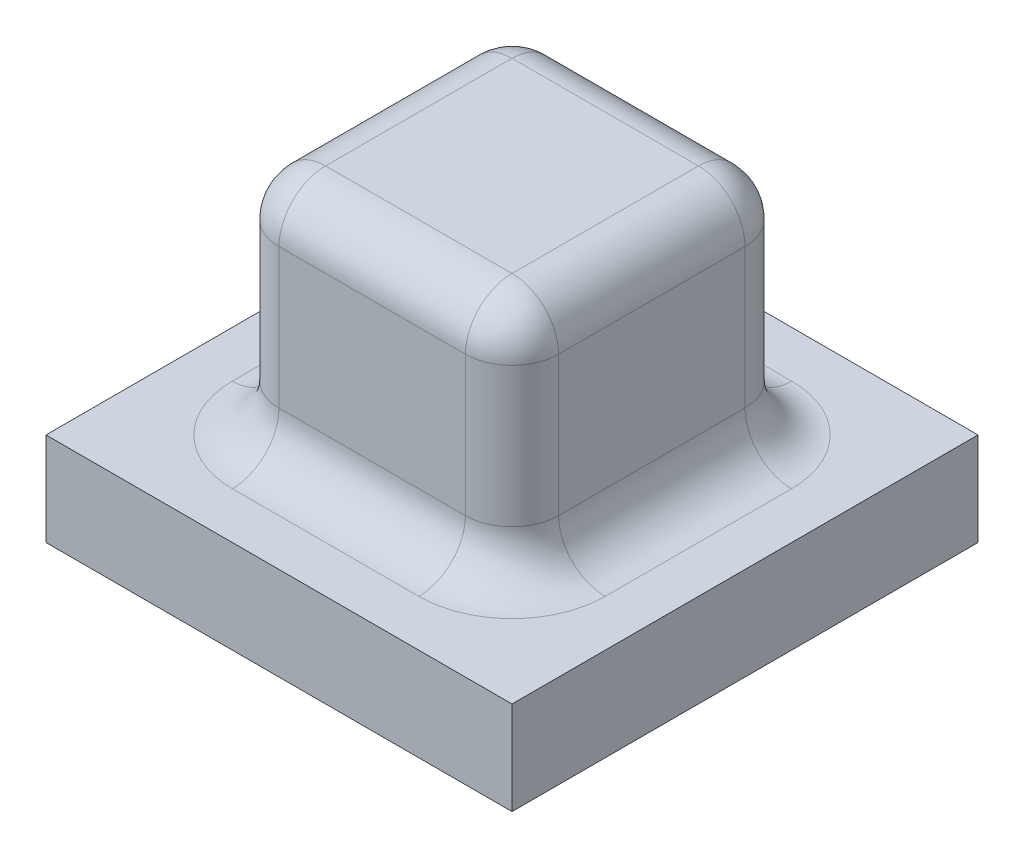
ISO-10303-21;
HEADER;
FILE_DESCRIPTION(('STEP AP214'),'2;1');
FILE_NAME('part.step','',(''),(''),'','','');
FILE_SCHEMA(('AUTOMOTIVE_DESIGN { 1 0 10303 214 1 1 1 1 }'));
ENDSEC;
DATA;
#1=APPLICATION_CONTEXT('core data for automotive mechanical design processes');
#2=APPLICATION_PROTOCOL_DEFINITION('international standard','automotive_design',2000,#1);
#3=PRODUCT_CONTEXT('',#1,'mechanical');
#4=PRODUCT('Part','Part','',(#3));
#5=PRODUCT_RELATED_PRODUCT_CATEGORY('part','',(#4));
#6=PRODUCT_DEFINITION_FORMATION('','',#4);
#7=PRODUCT_DEFINITION_CONTEXT('part definition',#1,'design');
#8=PRODUCT_DEFINITION('design','',#6,#7);
#9=PRODUCT_DEFINITION_SHAPE('','',#8);
#10=(LENGTH_UNIT() NAMED_UNIT(*) SI_UNIT(.MILLI.,.METRE.));
#11=(NAMED_UNIT(*) PLANE_ANGLE_UNIT() SI_UNIT($,.RADIAN.));
#12=(NAMED_UNIT(*) SI_UNIT($,.STERADIAN.) SOLID_ANGLE_UNIT());
#13=UNCERTAINTY_MEASURE_WITH_UNIT(LENGTH_MEASURE(1.E-05),#10,'distance_accuracy_value','');
#14=(GEOMETRIC_REPRESENTATION_CONTEXT(3) GLOBAL_UNCERTAINTY_ASSIGNED_CONTEXT((#13)) GLOBAL_UNIT_ASSIGNED_CONTEXT((#10,
#11,#12)) REPRESENTATION_CONTEXT('',''));
#15=CARTESIAN_POINT('',(0.,0.,0.));
#16=DIRECTION('',(0.,0.,1.));
#17=DIRECTION('',(1.,0.,0.));
#18=AXIS2_PLACEMENT_3D('',#15,#16,#17);
#19=CARTESIAN_POINT('',(-50.,20.,50.));
#20=DIRECTION('',(0.,-1.,0.));
#21=DIRECTION('',(1.,0.,0.));
#22=AXIS2_PLACEMENT_3D('',#19,#20,#21);
#23=PLANE('',#22);
#24=CARTESIAN_POINT('',(-20.,20.,-20.));
#25=DIRECTION('',(0.,-1.,0.));
#26=DIRECTION('',(1.,0.,0.));
#27=AXIS2_PLACEMENT_3D('',#24,#25,#26);
#28=CIRCLE('',#27,20.);
#29=CARTESIAN_POINT('',(-20.,20.,-40.));
#30=VERTEX_POINT('',#29);
#31=CARTESIAN_POINT('',(-40.,20.,-20.));
#32=VERTEX_POINT('',#31);
#33=EDGE_CURVE('E220',#30,#32,#28,.F.);
#34=ORIENTED_EDGE('',*,*,#33,.F.);
#35=DIRECTION('',(-1.,0.,0.));
#36=VECTOR('',#35,1.);
#37=CARTESIAN_POINT('',(30.,20.,-40.));
#38=LINE('',#37,#36);
#39=CARTESIAN_POINT('',(20.,20.,-40.));
#40=VERTEX_POINT('',#39);
#41=EDGE_CURVE('E226',#30,#40,#38,.F.);
#42=ORIENTED_EDGE('',*,*,#41,.T.);
#43=CARTESIAN_POINT('',(20.,20.,-20.));
#44=DIRECTION('',(0.,-1.,0.));
#45=DIRECTION('',(1.,0.,0.));
#46=AXIS2_PLACEMENT_3D('',#43,#44,#45);
#47=CIRCLE('',#46,20.);
#48=CARTESIAN_POINT('',(40.,20.,-20.));
#49=VERTEX_POINT('',#48);
#50=EDGE_CURVE('E223',#49,#40,#47,.F.);
#51=ORIENTED_EDGE('',*,*,#50,.F.);
#52=DIRECTION('',(0.,0.,-1.));
#53=VECTOR('',#52,1.);
#54=CARTESIAN_POINT('',(40.,20.,30.));
#55=LINE('',#54,#53);
#56=CARTESIAN_POINT('',(40.,20.,20.));
#57=VERTEX_POINT('',#56);
#58=EDGE_CURVE('E217',#49,#57,#55,.F.);
#59=ORIENTED_EDGE('',*,*,#58,.T.);
#60=CARTESIAN_POINT('',(20.,20.,20.));
#61=DIRECTION('',(0.,-1.,0.));
#62=DIRECTION('',(1.,0.,0.));
#63=AXIS2_PLACEMENT_3D('',#60,#61,#62);
#64=CIRCLE('',#63,20.);
#65=CARTESIAN_POINT('',(20.,20.,40.));
#66=VERTEX_POINT('',#65);
#67=EDGE_CURVE('E214',#66,#57,#64,.F.);
#68=ORIENTED_EDGE('',*,*,#67,.F.);
#69=DIRECTION('',(1.,0.,0.));
#70=VECTOR('',#69,1.);
#71=CARTESIAN_POINT('',(-30.,20.,40.));
#72=LINE('',#71,#70);
#73=CARTESIAN_POINT('',(-20.,20.,40.));
#74=VERTEX_POINT('',#73);
#75=EDGE_CURVE('E210',#66,#74,#72,.F.);
#76=ORIENTED_EDGE('',*,*,#75,.T.);
#77=CARTESIAN_POINT('',(-20.,20.,20.));
#78=DIRECTION('',(0.,-1.,0.));
#79=DIRECTION('',(1.,0.,0.));
#80=AXIS2_PLACEMENT_3D('',#77,#78,#79);
#81=CIRCLE('',#80,20.);
#82=CARTESIAN_POINT('',(-40.,20.,20.));
#83=VERTEX_POINT('',#82);
#84=EDGE_CURVE('E207',#83,#74,#81,.F.);
#85=ORIENTED_EDGE('',*,*,#84,.F.);
#86=DIRECTION('',(0.,0.,1.));
#87=VECTOR('',#86,1.);
#88=CARTESIAN_POINT('',(-40.,20.,-30.));
#89=LINE('',#88,#87);
#90=EDGE_CURVE('E212',#83,#32,#89,.F.);
#91=ORIENTED_EDGE('',*,*,#90,.T.);
#92=EDGE_LOOP('',(#34,#42,#51,#59,#68,#76,#85,#91));
#93=FACE_BOUND('',#92,.T.);
#94=DIRECTION('',(-1.,0.,0.));
#95=VECTOR('',#94,1.);
#96=CARTESIAN_POINT('',(-50.,20.,-50.));
#97=LINE('',#96,#95);
#98=CARTESIAN_POINT('',(50.,20.,-50.));
#99=VERTEX_POINT('',#98);
#100=CARTESIAN_POINT('',(-50.,20.,-50.));
#101=VERTEX_POINT('',#100);
#102=EDGE_CURVE('E185',#99,#101,#97,.T.);
#103=ORIENTED_EDGE('',*,*,#102,.T.);
#104=DIRECTION('',(0.,0.,-1.));
#105=VECTOR('',#104,1.);
#106=CARTESIAN_POINT('',(-50.,20.,50.));
#107=LINE('',#106,#105);
#108=CARTESIAN_POINT('',(-50.,20.,50.));
#109=VERTEX_POINT('',#108);
#110=EDGE_CURVE('E176',#109,#101,#107,.T.);
#111=ORIENTED_EDGE('',*,*,#110,.F.);
#112=DIRECTION('',(-1.,0.,0.));
#113=VECTOR('',#112,1.);
#114=CARTESIAN_POINT('',(-50.,20.,50.));
#115=LINE('',#114,#113);
#116=CARTESIAN_POINT('',(50.,20.,50.));
#117=VERTEX_POINT('',#116);
#118=EDGE_CURVE('E192',#117,#109,#115,.T.);
#119=ORIENTED_EDGE('',*,*,#118,.F.);
#120=DIRECTION('',(0.,0.,-1.));
#121=VECTOR('',#120,1.);
#122=CARTESIAN_POINT('',(50.,20.,50.));
#123=LINE('',#122,#121);
#124=EDGE_CURVE('E195',#117,#99,#123,.T.);
#125=ORIENTED_EDGE('',*,*,#124,.T.);
#126=EDGE_LOOP('',(#103,#111,#119,#125));
#127=FACE_BOUND('',#126,.T.);
#128=ADVANCED_FACE('F31',(#93,#127),#23,.F.);
#129=CARTESIAN_POINT('',(-50.,20.,50.));
#130=DIRECTION('',(1.,0.,0.));
#131=DIRECTION('',(0.,1.,0.));
#132=AXIS2_PLACEMENT_3D('',#129,#130,#131);
#133=PLANE('',#132);
#134=DIRECTION('',(0.,-1.,0.));
#135=VECTOR('',#134,1.);
#136=CARTESIAN_POINT('',(-50.,20.,-50.));
#137=LINE('',#136,#135);
#138=CARTESIAN_POINT('',(-50.,0.,-50.));
#139=VERTEX_POINT('',#138);
#140=EDGE_CURVE('E158',#101,#139,#137,.T.);
#141=ORIENTED_EDGE('',*,*,#140,.T.);
#142=DIRECTION('',(0.,0.,-1.));
#143=VECTOR('',#142,1.);
#144=CARTESIAN_POINT('',(-50.,0.,50.));
#145=LINE('',#144,#143);
#146=CARTESIAN_POINT('',(-50.,0.,50.));
#147=VERTEX_POINT('',#146);
#148=EDGE_CURVE('E165',#147,#139,#145,.T.);
#149=ORIENTED_EDGE('',*,*,#148,.F.);
#150=DIRECTION('',(0.,-1.,0.));
#151=VECTOR('',#150,1.);
#152=CARTESIAN_POINT('',(-50.,20.,50.));
#153=LINE('',#152,#151);
#154=EDGE_CURVE('E187',#109,#147,#153,.T.);
#155=ORIENTED_EDGE('',*,*,#154,.F.);
#156=ORIENTED_EDGE('',*,*,#110,.T.);
#157=EDGE_LOOP('',(#141,#149,#155,#156));
#158=FACE_BOUND('',#157,.T.);
#159=ADVANCED_FACE('F33',(#158),#133,.F.);
#160=CARTESIAN_POINT('',(-50.,0.,50.));
#161=DIRECTION('',(0.,1.,0.));
#162=DIRECTION('',(0.,0.,1.));
#163=AXIS2_PLACEMENT_3D('',#160,#161,#162);
#164=PLANE('',#163);
#165=DIRECTION('',(1.,0.,0.));
#166=VECTOR('',#165,1.);
#167=CARTESIAN_POINT('',(-50.,0.,-50.));
#168=LINE('',#167,#166);
#169=CARTESIAN_POINT('',(50.,0.,-50.));
#170=VERTEX_POINT('',#169);
#171=EDGE_CURVE('E153',#139,#170,#168,.T.);
#172=ORIENTED_EDGE('',*,*,#171,.T.);
#173=DIRECTION('',(0.,0.,-1.));
#174=VECTOR('',#173,1.);
#175=CARTESIAN_POINT('',(50.,0.,50.));
#176=LINE('',#175,#174);
#177=CARTESIAN_POINT('',(50.,0.,50.));
#178=VERTEX_POINT('',#177);
#179=EDGE_CURVE('E172',#178,#170,#176,.T.);
#180=ORIENTED_EDGE('',*,*,#179,.F.);
#181=DIRECTION('',(1.,0.,0.));
#182=VECTOR('',#181,1.);
#183=CARTESIAN_POINT('',(-50.,0.,50.));
#184=LINE('',#183,#182);
#185=EDGE_CURVE('E167',#147,#178,#184,.T.);
#186=ORIENTED_EDGE('',*,*,#185,.F.);
#187=ORIENTED_EDGE('',*,*,#148,.T.);
#188=EDGE_LOOP('',(#172,#180,#186,#187));
#189=FACE_BOUND('',#188,.T.);
#190=ADVANCED_FACE('F166',(#189),#164,.F.);
#191=CARTESIAN_POINT('',(50.,20.,50.));
#192=DIRECTION('',(-1.,0.,0.));
#193=DIRECTION('',(0.,0.,1.));
#194=AXIS2_PLACEMENT_3D('',#191,#192,#193);
#195=PLANE('',#194);
#196=DIRECTION('',(0.,1.,0.));
#197=VECTOR('',#196,1.);
#198=CARTESIAN_POINT('',(50.,20.,-50.));
#199=LINE('',#198,#197);
#200=EDGE_CURVE('E159',#170,#99,#199,.T.);
#201=ORIENTED_EDGE('',*,*,#200,.T.);
#202=ORIENTED_EDGE('',*,*,#124,.F.);
#203=DIRECTION('',(0.,1.,0.));
#204=VECTOR('',#203,1.);
#205=CARTESIAN_POINT('',(50.,20.,50.));
#206=LINE('',#205,#204);
#207=EDGE_CURVE('E190',#178,#117,#206,.T.);
#208=ORIENTED_EDGE('',*,*,#207,.F.);
#209=ORIENTED_EDGE('',*,*,#179,.T.);
#210=EDGE_LOOP('',(#201,#202,#208,#209));
#211=FACE_BOUND('',#210,.T.);
#212=ADVANCED_FACE('F427',(#211),#195,.F.);
#213=CARTESIAN_POINT('',(-50.,20.,50.));
#214=DIRECTION('',(0.,0.,1.));
#215=DIRECTION('',(1.,0.,0.));
#216=AXIS2_PLACEMENT_3D('',#213,#214,#215);
#217=PLANE('',#216);
#218=ORIENTED_EDGE('',*,*,#154,.T.);
#219=ORIENTED_EDGE('',*,*,#185,.T.);
#220=ORIENTED_EDGE('',*,*,#207,.T.);
#221=ORIENTED_EDGE('',*,*,#118,.T.);
#222=EDGE_LOOP('',(#218,#219,#220,#221));
#223=FACE_BOUND('',#222,.T.);
#224=ADVANCED_FACE('F418',(#223),#217,.T.);
#225=CARTESIAN_POINT('',(-50.,20.,-50.));
#226=DIRECTION('',(0.,0.,1.));
#227=DIRECTION('',(1.,0.,0.));
#228=AXIS2_PLACEMENT_3D('',#225,#226,#227);
#229=PLANE('',#228);
#230=ORIENTED_EDGE('',*,*,#140,.F.);
#231=ORIENTED_EDGE('',*,*,#102,.F.);
#232=ORIENTED_EDGE('',*,*,#200,.F.);
#233=ORIENTED_EDGE('',*,*,#171,.F.);
#234=EDGE_LOOP('',(#230,#231,#232,#233));
#235=FACE_BOUND('',#234,.T.);
#236=ADVANCED_FACE('F155',(#235),#229,.F.);
#237=CARTESIAN_POINT('',(30.,70.,30.));
#238=DIRECTION('',(-1.,0.,0.));
#239=DIRECTION('',(0.,-1.,0.));
#240=AXIS2_PLACEMENT_3D('',#237,#238,#239);
#241=PLANE('',#240);
#242=DIRECTION('',(0.,-1.,0.));
#243=VECTOR('',#242,1.);
#244=CARTESIAN_POINT('',(30.,70.,20.));
#245=LINE('',#244,#243);
#246=CARTESIAN_POINT('',(30.,60.,20.));
#247=VERTEX_POINT('',#246);
#248=CARTESIAN_POINT('',(30.,30.,20.));
#249=VERTEX_POINT('',#248);
#250=EDGE_CURVE('E200',#247,#249,#245,.T.);
#251=ORIENTED_EDGE('',*,*,#250,.T.);
#252=DIRECTION('',(0.,0.,-1.));
#253=VECTOR('',#252,1.);
#254=CARTESIAN_POINT('',(30.,30.,-30.));
#255=LINE('',#254,#253);
#256=CARTESIAN_POINT('',(30.,30.,-20.));
#257=VERTEX_POINT('',#256);
#258=EDGE_CURVE('E204',#249,#257,#255,.T.);
#259=ORIENTED_EDGE('',*,*,#258,.T.);
#260=DIRECTION('',(0.,-1.,0.));
#261=VECTOR('',#260,1.);
#262=CARTESIAN_POINT('',(30.,70.,-20.));
#263=LINE('',#262,#261);
#264=CARTESIAN_POINT('',(30.,60.,-20.));
#265=VERTEX_POINT('',#264);
#266=EDGE_CURVE('E202',#257,#265,#263,.F.);
#267=ORIENTED_EDGE('',*,*,#266,.T.);
#268=DIRECTION('',(0.,0.,-1.));
#269=VECTOR('',#268,1.);
#270=CARTESIAN_POINT('',(30.,60.,30.));
#271=LINE('',#270,#269);
#272=EDGE_CURVE('E171',#265,#247,#271,.F.);
#273=ORIENTED_EDGE('',*,*,#272,.T.);
#274=EDGE_LOOP('',(#251,#259,#267,#273));
#275=FACE_BOUND('',#274,.T.);
#276=ADVANCED_FACE('F408',(#275),#241,.F.);
#277=CARTESIAN_POINT('',(30.,70.,-30.));
#278=DIRECTION('',(0.,0.,1.));
#279=DIRECTION('',(1.,0.,0.));
#280=AXIS2_PLACEMENT_3D('',#277,#278,#279);
#281=PLANE('',#280);
#282=DIRECTION('',(-1.,0.,0.));
#283=VECTOR('',#282,1.);
#284=CARTESIAN_POINT('',(30.,60.,-30.));
#285=LINE('',#284,#283);
#286=CARTESIAN_POINT('',(-20.,60.,-30.));
#287=VERTEX_POINT('',#286);
#288=CARTESIAN_POINT('',(20.,60.,-30.));
#289=VERTEX_POINT('',#288);
#290=EDGE_CURVE('E228',#287,#289,#285,.F.);
#291=ORIENTED_EDGE('',*,*,#290,.T.);
#292=DIRECTION('',(0.,-1.,0.));
#293=VECTOR('',#292,1.);
#294=CARTESIAN_POINT('',(20.,70.,-30.));
#295=LINE('',#294,#293);
#296=CARTESIAN_POINT('',(20.,30.,-30.));
#297=VERTEX_POINT('',#296);
#298=EDGE_CURVE('E234',#289,#297,#295,.T.);
#299=ORIENTED_EDGE('',*,*,#298,.T.);
#300=DIRECTION('',(-1.,0.,0.));
#301=VECTOR('',#300,1.);
#302=CARTESIAN_POINT('',(-30.,30.,-30.));
#303=LINE('',#302,#301);
#304=CARTESIAN_POINT('',(-20.,30.,-30.));
#305=VERTEX_POINT('',#304);
#306=EDGE_CURVE('E232',#297,#305,#303,.T.);
#307=ORIENTED_EDGE('',*,*,#306,.T.);
#308=DIRECTION('',(0.,-1.,0.));
#309=VECTOR('',#308,1.);
#310=CARTESIAN_POINT('',(-20.,70.,-30.));
#311=LINE('',#310,#309);
#312=EDGE_CURVE('E230',#305,#287,#311,.F.);
#313=ORIENTED_EDGE('',*,*,#312,.T.);
#314=EDGE_LOOP('',(#291,#299,#307,#313));
#315=FACE_BOUND('',#314,.T.);
#316=ADVANCED_FACE('F410',(#315),#281,.F.);
#317=CARTESIAN_POINT('',(-30.,70.,30.));
#318=DIRECTION('',(1.,0.,0.));
#319=DIRECTION('',(0.,1.,0.));
#320=AXIS2_PLACEMENT_3D('',#317,#318,#319);
#321=PLANE('',#320);
#322=DIRECTION('',(0.,0.,1.));
#323=VECTOR('',#322,1.);
#324=CARTESIAN_POINT('',(-30.,60.,-30.));
#325=LINE('',#324,#323);
#326=CARTESIAN_POINT('',(-30.,60.,20.));
#327=VERTEX_POINT('',#326);
#328=CARTESIAN_POINT('',(-30.,60.,-20.));
#329=VERTEX_POINT('',#328);
#330=EDGE_CURVE('E237',#327,#329,#325,.F.);
#331=ORIENTED_EDGE('',*,*,#330,.T.);
#332=DIRECTION('',(0.,-1.,0.));
#333=VECTOR('',#332,1.);
#334=CARTESIAN_POINT('',(-30.,70.,-20.));
#335=LINE('',#334,#333);
#336=CARTESIAN_POINT('',(-30.,30.,-20.));
#337=VERTEX_POINT('',#336);
#338=EDGE_CURVE('E243',#329,#337,#335,.T.);
#339=ORIENTED_EDGE('',*,*,#338,.T.);
#340=DIRECTION('',(0.,0.,1.));
#341=VECTOR('',#340,1.);
#342=CARTESIAN_POINT('',(-30.,30.,30.));
#343=LINE('',#342,#341);
#344=CARTESIAN_POINT('',(-30.,30.,20.));
#345=VERTEX_POINT('',#344);
#346=EDGE_CURVE('E241',#337,#345,#343,.T.);
#347=ORIENTED_EDGE('',*,*,#346,.T.);
#348=DIRECTION('',(0.,-1.,0.));
#349=VECTOR('',#348,1.);
#350=CARTESIAN_POINT('',(-30.,70.,20.));
#351=LINE('',#350,#349);
#352=EDGE_CURVE('E239',#345,#327,#351,.F.);
#353=ORIENTED_EDGE('',*,*,#352,.T.);
#354=EDGE_LOOP('',(#331,#339,#347,#353));
#355=FACE_BOUND('',#354,.T.);
#356=ADVANCED_FACE('F362',(#355),#321,.F.);
#357=CARTESIAN_POINT('',(30.,70.,30.));
#358=DIRECTION('',(0.,0.,-1.));
#359=DIRECTION('',(-1.,0.,0.));
#360=AXIS2_PLACEMENT_3D('',#357,#358,#359);
#361=PLANE('',#360);
#362=DIRECTION('',(0.,-1.,0.));
#363=VECTOR('',#362,1.);
#364=CARTESIAN_POINT('',(-20.,70.,30.));
#365=LINE('',#364,#363);
#366=CARTESIAN_POINT('',(-20.,60.,30.));
#367=VERTEX_POINT('',#366);
#368=CARTESIAN_POINT('',(-20.,30.,30.));
#369=VERTEX_POINT('',#368);
#370=EDGE_CURVE('E250',#367,#369,#365,.T.);
#371=ORIENTED_EDGE('',*,*,#370,.T.);
#372=DIRECTION('',(1.,0.,0.));
#373=VECTOR('',#372,1.);
#374=CARTESIAN_POINT('',(30.,30.,30.));
#375=LINE('',#374,#373);
#376=CARTESIAN_POINT('',(20.,30.,30.));
#377=VERTEX_POINT('',#376);
#378=EDGE_CURVE('E253',#369,#377,#375,.T.);
#379=ORIENTED_EDGE('',*,*,#378,.T.);
#380=DIRECTION('',(0.,-1.,0.));
#381=VECTOR('',#380,1.);
#382=CARTESIAN_POINT('',(20.,70.,30.));
#383=LINE('',#382,#381);
#384=CARTESIAN_POINT('',(20.,60.,30.));
#385=VERTEX_POINT('',#384);
#386=EDGE_CURVE('E248',#377,#385,#383,.F.);
#387=ORIENTED_EDGE('',*,*,#386,.T.);
#388=DIRECTION('',(1.,0.,0.));
#389=VECTOR('',#388,1.);
#390=CARTESIAN_POINT('',(-30.,60.,30.));
#391=LINE('',#390,#389);
#392=EDGE_CURVE('E246',#385,#367,#391,.F.);
#393=ORIENTED_EDGE('',*,*,#392,.T.);
#394=EDGE_LOOP('',(#371,#379,#387,#393));
#395=FACE_BOUND('',#394,.T.);
#396=ADVANCED_FACE('F367',(#395),#361,.F.);
#397=CARTESIAN_POINT('',(30.,70.,-30.));
#398=DIRECTION('',(0.,1.,0.));
#399=DIRECTION('',(-1.,0.,0.));
#400=AXIS2_PLACEMENT_3D('',#397,#398,#399);
#401=PLANE('',#400);
#402=DIRECTION('',(0.,0.,1.));
#403=VECTOR('',#402,1.);
#404=CARTESIAN_POINT('',(-20.,70.,30.));
#405=LINE('',#404,#403);
#406=CARTESIAN_POINT('',(-20.,70.,-20.));
#407=VERTEX_POINT('',#406);
#408=CARTESIAN_POINT('',(-20.,70.,20.));
#409=VERTEX_POINT('',#408);
#410=EDGE_CURVE('E39',#407,#409,#405,.T.);
#411=ORIENTED_EDGE('',*,*,#410,.T.);
#412=DIRECTION('',(1.,0.,0.));
#413=VECTOR('',#412,1.);
#414=CARTESIAN_POINT('',(30.,70.,20.));
#415=LINE('',#414,#413);
#416=CARTESIAN_POINT('',(20.,70.,20.));
#417=VERTEX_POINT('',#416);
#418=EDGE_CURVE('E11',#409,#417,#415,.T.);
#419=ORIENTED_EDGE('',*,*,#418,.T.);
#420=DIRECTION('',(0.,0.,-1.));
#421=VECTOR('',#420,1.);
#422=CARTESIAN_POINT('',(20.,70.,-30.));
#423=LINE('',#422,#421);
#424=CARTESIAN_POINT('',(20.,70.,-20.));
#425=VERTEX_POINT('',#424);
#426=EDGE_CURVE('E255',#417,#425,#423,.T.);
#427=ORIENTED_EDGE('',*,*,#426,.T.);
#428=DIRECTION('',(-1.,0.,0.));
#429=VECTOR('',#428,1.);
#430=CARTESIAN_POINT('',(-30.,70.,-20.));
#431=LINE('',#430,#429);
#432=EDGE_CURVE('E49',#425,#407,#431,.T.);
#433=ORIENTED_EDGE('',*,*,#432,.T.);
#434=EDGE_LOOP('',(#411,#419,#427,#433));
#435=FACE_BOUND('',#434,.T.);
#436=ADVANCED_FACE('F258',(#435),#401,.T.);
#437=CARTESIAN_POINT('',(-20.,60.,-30.));
#438=DIRECTION('',(0.,0.,-1.));
#439=DIRECTION('',(-1.,0.,0.));
#440=AXIS2_PLACEMENT_3D('',#437,#438,#439);
#441=CYLINDRICAL_SURFACE('',#440,10.);
#442=CARTESIAN_POINT('',(-20.,60.,20.));
#443=DIRECTION('',(0.,0.,1.));
#444=DIRECTION('',(1.,0.,0.));
#445=AXIS2_PLACEMENT_3D('',#442,#443,#444);
#446=CIRCLE('',#445,10.);
#447=EDGE_CURVE('E177',#409,#327,#446,.T.);
#448=ORIENTED_EDGE('',*,*,#447,.F.);
#449=ORIENTED_EDGE('',*,*,#410,.F.);
#450=CARTESIAN_POINT('',(-20.,60.,-20.));
#451=DIRECTION('',(0.,0.,-1.));
#452=DIRECTION('',(0.,1.,0.));
#453=AXIS2_PLACEMENT_3D('',#450,#451,#452);
#454=CIRCLE('',#453,10.);
#455=EDGE_CURVE('E180',#329,#407,#454,.T.);
#456=ORIENTED_EDGE('',*,*,#455,.F.);
#457=ORIENTED_EDGE('',*,*,#330,.F.);
#458=EDGE_LOOP('',(#448,#449,#456,#457));
#459=FACE_BOUND('',#458,.T.);
#460=ADVANCED_FACE('F318',(#459),#441,.T.);
#461=CARTESIAN_POINT('',(-20.,60.,20.));
#462=DIRECTION('',(0.,0.,1.));
#463=DIRECTION('',(1.,0.,0.));
#464=AXIS2_PLACEMENT_3D('',#461,#462,#463);
#465=SPHERICAL_SURFACE('',#464,10.);
#466=CARTESIAN_POINT('',(-20.,60.,20.));
#467=DIRECTION('',(-1.,0.,0.));
#468=DIRECTION('',(0.,-1.,0.));
#469=AXIS2_PLACEMENT_3D('',#466,#467,#468);
#470=CIRCLE('',#469,10.);
#471=EDGE_CURVE('E305',#409,#367,#470,.F.);
#472=ORIENTED_EDGE('',*,*,#471,.F.);
#473=ORIENTED_EDGE('',*,*,#447,.T.);
#474=CARTESIAN_POINT('',(-20.,60.,20.));
#475=DIRECTION('',(0.,1.,0.));
#476=DIRECTION('',(0.,0.,1.));
#477=AXIS2_PLACEMENT_3D('',#474,#475,#476);
#478=CIRCLE('',#477,10.);
#479=EDGE_CURVE('E308',#367,#327,#478,.F.);
#480=ORIENTED_EDGE('',*,*,#479,.F.);
#481=EDGE_LOOP('',(#472,#473,#480));
#482=FACE_BOUND('',#481,.T.);
#483=ADVANCED_FACE('F322',(#482),#465,.T.);
#484=CARTESIAN_POINT('',(-20.,60.,-20.));
#485=DIRECTION('',(0.,0.,1.));
#486=DIRECTION('',(1.,0.,0.));
#487=AXIS2_PLACEMENT_3D('',#484,#485,#486);
#488=SPHERICAL_SURFACE('',#487,10.);
#489=CARTESIAN_POINT('',(-20.,60.,-20.));
#490=DIRECTION('',(0.,1.,0.));
#491=DIRECTION('',(0.,0.,1.));
#492=AXIS2_PLACEMENT_3D('',#489,#490,#491);
#493=CIRCLE('',#492,10.);
#494=EDGE_CURVE('E301',#329,#287,#493,.F.);
#495=ORIENTED_EDGE('',*,*,#494,.F.);
#496=ORIENTED_EDGE('',*,*,#455,.T.);
#497=CARTESIAN_POINT('',(-20.,60.,-20.));
#498=DIRECTION('',(-1.,0.,0.));
#499=DIRECTION('',(0.,0.,1.));
#500=AXIS2_PLACEMENT_3D('',#497,#498,#499);
#501=CIRCLE('',#500,10.);
#502=EDGE_CURVE('E272',#287,#407,#501,.F.);
#503=ORIENTED_EDGE('',*,*,#502,.F.);
#504=EDGE_LOOP('',(#495,#496,#503));
#505=FACE_BOUND('',#504,.T.);
#506=ADVANCED_FACE('F314',(#505),#488,.T.);
#507=CARTESIAN_POINT('',(-20.,70.,20.));
#508=DIRECTION('',(0.,-1.,0.));
#509=DIRECTION('',(1.,0.,0.));
#510=AXIS2_PLACEMENT_3D('',#507,#508,#509);
#511=CYLINDRICAL_SURFACE('',#510,10.);
#512=ORIENTED_EDGE('',*,*,#479,.T.);
#513=ORIENTED_EDGE('',*,*,#352,.F.);
#514=CARTESIAN_POINT('',(-20.,30.,20.));
#515=DIRECTION('',(0.,-1.,0.));
#516=DIRECTION('',(1.,0.,0.));
#517=AXIS2_PLACEMENT_3D('',#514,#515,#516);
#518=CIRCLE('',#517,10.);
#519=EDGE_CURVE('E295',#369,#345,#518,.T.);
#520=ORIENTED_EDGE('',*,*,#519,.F.);
#521=ORIENTED_EDGE('',*,*,#370,.F.);
#522=EDGE_LOOP('',(#512,#513,#520,#521));
#523=FACE_BOUND('',#522,.T.);
#524=ADVANCED_FACE('F365',(#523),#511,.T.);
#525=CARTESIAN_POINT('',(30.,60.,20.));
#526=DIRECTION('',(-1.,0.,0.));
#527=DIRECTION('',(0.,-1.,0.));
#528=AXIS2_PLACEMENT_3D('',#525,#526,#527);
#529=CYLINDRICAL_SURFACE('',#528,10.);
#530=ORIENTED_EDGE('',*,*,#471,.T.);
#531=ORIENTED_EDGE('',*,*,#392,.F.);
#532=CARTESIAN_POINT('',(20.,60.,20.));
#533=DIRECTION('',(1.,0.,0.));
#534=DIRECTION('',(0.,0.,-1.));
#535=AXIS2_PLACEMENT_3D('',#532,#533,#534);
#536=CIRCLE('',#535,10.);
#537=EDGE_CURVE('E292',#417,#385,#536,.T.);
#538=ORIENTED_EDGE('',*,*,#537,.F.);
#539=ORIENTED_EDGE('',*,*,#418,.F.);
#540=EDGE_LOOP('',(#530,#531,#538,#539));
#541=FACE_BOUND('',#540,.T.);
#542=ADVANCED_FACE('F327',(#541),#529,.T.);
#543=CARTESIAN_POINT('',(20.,60.,-30.));
#544=DIRECTION('',(0.,0.,1.));
#545=DIRECTION('',(1.,0.,0.));
#546=AXIS2_PLACEMENT_3D('',#543,#544,#545);
#547=CYLINDRICAL_SURFACE('',#546,10.);
#548=CARTESIAN_POINT('',(20.,60.,-20.));
#549=DIRECTION('',(0.,0.,-1.));
#550=DIRECTION('',(-1.,0.,0.));
#551=AXIS2_PLACEMENT_3D('',#548,#549,#550);
#552=CIRCLE('',#551,10.);
#553=EDGE_CURVE('E275',#425,#265,#552,.T.);
#554=ORIENTED_EDGE('',*,*,#553,.F.);
#555=ORIENTED_EDGE('',*,*,#426,.F.);
#556=CARTESIAN_POINT('',(20.,60.,20.));
#557=DIRECTION('',(0.,0.,1.));
#558=DIRECTION('',(0.,-1.,0.));
#559=AXIS2_PLACEMENT_3D('',#556,#557,#558);
#560=CIRCLE('',#559,10.);
#561=EDGE_CURVE('E279',#247,#417,#560,.T.);
#562=ORIENTED_EDGE('',*,*,#561,.F.);
#563=ORIENTED_EDGE('',*,*,#272,.F.);
#564=EDGE_LOOP('',(#554,#555,#562,#563));
#565=FACE_BOUND('',#564,.T.);
#566=ADVANCED_FACE('F276',(#565),#547,.T.);
#567=CARTESIAN_POINT('',(30.,60.,-20.));
#568=DIRECTION('',(1.,0.,0.));
#569=DIRECTION('',(0.,1.,0.));
#570=AXIS2_PLACEMENT_3D('',#567,#568,#569);
#571=CYLINDRICAL_SURFACE('',#570,10.);
#572=ORIENTED_EDGE('',*,*,#502,.T.);
#573=ORIENTED_EDGE('',*,*,#432,.F.);
#574=CARTESIAN_POINT('',(20.,60.,-20.));
#575=DIRECTION('',(1.,0.,0.));
#576=DIRECTION('',(0.,1.,0.));
#577=AXIS2_PLACEMENT_3D('',#574,#575,#576);
#578=CIRCLE('',#577,10.);
#579=EDGE_CURVE('E269',#289,#425,#578,.T.);
#580=ORIENTED_EDGE('',*,*,#579,.F.);
#581=ORIENTED_EDGE('',*,*,#290,.F.);
#582=EDGE_LOOP('',(#572,#573,#580,#581));
#583=FACE_BOUND('',#582,.T.);
#584=ADVANCED_FACE('F266',(#583),#571,.T.);
#585=CARTESIAN_POINT('',(-20.,70.,-20.));
#586=DIRECTION('',(0.,-1.,0.));
#587=DIRECTION('',(1.,0.,0.));
#588=AXIS2_PLACEMENT_3D('',#585,#586,#587);
#589=CYLINDRICAL_SURFACE('',#588,10.);
#590=ORIENTED_EDGE('',*,*,#494,.T.);
#591=ORIENTED_EDGE('',*,*,#312,.F.);
#592=CARTESIAN_POINT('',(-20.,30.,-20.));
#593=DIRECTION('',(0.,-1.,0.));
#594=DIRECTION('',(1.,0.,0.));
#595=AXIS2_PLACEMENT_3D('',#592,#593,#594);
#596=CIRCLE('',#595,10.);
#597=EDGE_CURVE('E284',#337,#305,#596,.T.);
#598=ORIENTED_EDGE('',*,*,#597,.F.);
#599=ORIENTED_EDGE('',*,*,#338,.F.);
#600=EDGE_LOOP('',(#590,#591,#598,#599));
#601=FACE_BOUND('',#600,.T.);
#602=ADVANCED_FACE('F357',(#601),#589,.T.);
#603=CARTESIAN_POINT('',(-40.,30.,30.));
#604=DIRECTION('',(0.,0.,-1.));
#605=DIRECTION('',(-1.,0.,0.));
#606=AXIS2_PLACEMENT_3D('',#603,#604,#605);
#607=CYLINDRICAL_SURFACE('',#606,10.);
#608=CARTESIAN_POINT('',(-40.,30.,-20.));
#609=DIRECTION('',(0.,0.,1.));
#610=DIRECTION('',(1.,0.,0.));
#611=AXIS2_PLACEMENT_3D('',#608,#609,#610);
#612=CIRCLE('',#611,10.);
#613=EDGE_CURVE('E287',#32,#337,#612,.T.);
#614=ORIENTED_EDGE('',*,*,#613,.F.);
#615=ORIENTED_EDGE('',*,*,#90,.F.);
#616=CARTESIAN_POINT('',(-40.,30.,20.));
#617=DIRECTION('',(0.,0.,-1.));
#618=DIRECTION('',(-1.,0.,0.));
#619=AXIS2_PLACEMENT_3D('',#616,#617,#618);
#620=CIRCLE('',#619,10.);
#621=EDGE_CURVE('E298',#345,#83,#620,.T.);
#622=ORIENTED_EDGE('',*,*,#621,.F.);
#623=ORIENTED_EDGE('',*,*,#346,.F.);
#624=EDGE_LOOP('',(#614,#615,#622,#623));
#625=FACE_BOUND('',#624,.T.);
#626=ADVANCED_FACE('F359',(#625),#607,.F.);
#627=CARTESIAN_POINT('',(-20.,30.,20.));
#628=DIRECTION('',(0.,-1.,0.));
#629=DIRECTION('',(1.,0.,0.));
#630=AXIS2_PLACEMENT_3D('',#627,#628,#629);
#631=TOROIDAL_SURFACE('',#630,20.,10.);
#632=ORIENTED_EDGE('',*,*,#621,.T.);
#633=ORIENTED_EDGE('',*,*,#84,.T.);
#634=CARTESIAN_POINT('',(-20.,30.,40.));
#635=DIRECTION('',(1.,0.,0.));
#636=DIRECTION('',(0.,1.,0.));
#637=AXIS2_PLACEMENT_3D('',#634,#635,#636);
#638=CIRCLE('',#637,10.);
#639=EDGE_CURVE('E339',#369,#74,#638,.F.);
#640=ORIENTED_EDGE('',*,*,#639,.F.);
#641=ORIENTED_EDGE('',*,*,#519,.T.);
#642=EDGE_LOOP('',(#632,#633,#640,#641));
#643=FACE_BOUND('',#642,.T.);
#644=ADVANCED_FACE('F376',(#643),#631,.F.);
#645=CARTESIAN_POINT('',(20.,60.,20.));
#646=DIRECTION('',(0.,0.,1.));
#647=DIRECTION('',(1.,0.,0.));
#648=AXIS2_PLACEMENT_3D('',#645,#646,#647);
#649=SPHERICAL_SURFACE('',#648,10.);
#650=ORIENTED_EDGE('',*,*,#561,.T.);
#651=ORIENTED_EDGE('',*,*,#537,.T.);
#652=CARTESIAN_POINT('',(20.,60.,20.));
#653=DIRECTION('',(0.,1.,0.));
#654=DIRECTION('',(0.,0.,1.));
#655=AXIS2_PLACEMENT_3D('',#652,#653,#654);
#656=CIRCLE('',#655,10.);
#657=EDGE_CURVE('E332',#247,#385,#656,.F.);
#658=ORIENTED_EDGE('',*,*,#657,.F.);
#659=EDGE_LOOP('',(#650,#651,#658));
#660=FACE_BOUND('',#659,.T.);
#661=ADVANCED_FACE('F331',(#660),#649,.T.);
#662=CARTESIAN_POINT('',(20.,60.,-20.));
#663=DIRECTION('',(0.,0.,1.));
#664=DIRECTION('',(1.,0.,0.));
#665=AXIS2_PLACEMENT_3D('',#662,#663,#664);
#666=SPHERICAL_SURFACE('',#665,10.);
#667=ORIENTED_EDGE('',*,*,#579,.T.);
#668=ORIENTED_EDGE('',*,*,#553,.T.);
#669=CARTESIAN_POINT('',(20.,60.,-20.));
#670=DIRECTION('',(0.,1.,0.));
#671=DIRECTION('',(0.,0.,1.));
#672=AXIS2_PLACEMENT_3D('',#669,#670,#671);
#673=CIRCLE('',#672,10.);
#674=EDGE_CURVE('E282',#289,#265,#673,.F.);
#675=ORIENTED_EDGE('',*,*,#674,.F.);
#676=EDGE_LOOP('',(#667,#668,#675));
#677=FACE_BOUND('',#676,.T.);
#678=ADVANCED_FACE('F281',(#677),#666,.T.);
#679=CARTESIAN_POINT('',(-20.,30.,-20.));
#680=DIRECTION('',(0.,-1.,0.));
#681=DIRECTION('',(1.,0.,0.));
#682=AXIS2_PLACEMENT_3D('',#679,#680,#681);
#683=TOROIDAL_SURFACE('',#682,20.,10.);
#684=ORIENTED_EDGE('',*,*,#613,.T.);
#685=ORIENTED_EDGE('',*,*,#597,.T.);
#686=CARTESIAN_POINT('',(-20.,30.,-40.));
#687=DIRECTION('',(1.,0.,0.));
#688=DIRECTION('',(0.,1.,0.));
#689=AXIS2_PLACEMENT_3D('',#686,#687,#688);
#690=CIRCLE('',#689,10.);
#691=EDGE_CURVE('E343',#30,#305,#690,.F.);
#692=ORIENTED_EDGE('',*,*,#691,.F.);
#693=ORIENTED_EDGE('',*,*,#33,.T.);
#694=EDGE_LOOP('',(#684,#685,#692,#693));
#695=FACE_BOUND('',#694,.T.);
#696=ADVANCED_FACE('F349',(#695),#683,.F.);
#697=CARTESIAN_POINT('',(30.,30.,40.));
#698=DIRECTION('',(-1.,0.,0.));
#699=DIRECTION('',(0.,-1.,0.));
#700=AXIS2_PLACEMENT_3D('',#697,#698,#699);
#701=CYLINDRICAL_SURFACE('',#700,10.);
#702=ORIENTED_EDGE('',*,*,#639,.T.);
#703=ORIENTED_EDGE('',*,*,#75,.F.);
#704=CARTESIAN_POINT('',(20.,30.,40.));
#705=DIRECTION('',(-1.,0.,0.));
#706=DIRECTION('',(0.,-1.,0.));
#707=AXIS2_PLACEMENT_3D('',#704,#705,#706);
#708=CIRCLE('',#707,10.);
#709=EDGE_CURVE('E373',#377,#66,#708,.T.);
#710=ORIENTED_EDGE('',*,*,#709,.F.);
#711=ORIENTED_EDGE('',*,*,#378,.F.);
#712=EDGE_LOOP('',(#702,#703,#710,#711));
#713=FACE_BOUND('',#712,.T.);
#714=ADVANCED_FACE('F370',(#713),#701,.F.);
#715=CARTESIAN_POINT('',(20.,70.,20.));
#716=DIRECTION('',(0.,-1.,0.));
#717=DIRECTION('',(1.,0.,0.));
#718=AXIS2_PLACEMENT_3D('',#715,#716,#717);
#719=CYLINDRICAL_SURFACE('',#718,10.);
#720=ORIENTED_EDGE('',*,*,#657,.T.);
#721=ORIENTED_EDGE('',*,*,#386,.F.);
#722=CARTESIAN_POINT('',(20.,30.,20.));
#723=DIRECTION('',(0.,-1.,0.));
#724=DIRECTION('',(1.,0.,0.));
#725=AXIS2_PLACEMENT_3D('',#722,#723,#724);
#726=CIRCLE('',#725,10.);
#727=EDGE_CURVE('E382',#249,#377,#726,.T.);
#728=ORIENTED_EDGE('',*,*,#727,.F.);
#729=ORIENTED_EDGE('',*,*,#250,.F.);
#730=EDGE_LOOP('',(#720,#721,#728,#729));
#731=FACE_BOUND('',#730,.T.);
#732=ADVANCED_FACE('F336',(#731),#719,.T.);
#733=CARTESIAN_POINT('',(20.,70.,-20.));
#734=DIRECTION('',(0.,-1.,0.));
#735=DIRECTION('',(1.,0.,0.));
#736=AXIS2_PLACEMENT_3D('',#733,#734,#735);
#737=CYLINDRICAL_SURFACE('',#736,10.);
#738=ORIENTED_EDGE('',*,*,#674,.T.);
#739=ORIENTED_EDGE('',*,*,#266,.F.);
#740=CARTESIAN_POINT('',(20.,30.,-20.));
#741=DIRECTION('',(0.,-1.,0.));
#742=DIRECTION('',(1.,0.,0.));
#743=AXIS2_PLACEMENT_3D('',#740,#741,#742);
#744=CIRCLE('',#743,10.);
#745=EDGE_CURVE('E384',#297,#257,#744,.T.);
#746=ORIENTED_EDGE('',*,*,#745,.F.);
#747=ORIENTED_EDGE('',*,*,#298,.F.);
#748=EDGE_LOOP('',(#738,#739,#746,#747));
#749=FACE_BOUND('',#748,.T.);
#750=ADVANCED_FACE('F406',(#749),#737,.T.);
#751=CARTESIAN_POINT('',(30.,30.,-40.));
#752=DIRECTION('',(1.,0.,0.));
#753=DIRECTION('',(0.,1.,0.));
#754=AXIS2_PLACEMENT_3D('',#751,#752,#753);
#755=CYLINDRICAL_SURFACE('',#754,10.);
#756=ORIENTED_EDGE('',*,*,#691,.T.);
#757=ORIENTED_EDGE('',*,*,#306,.F.);
#758=CARTESIAN_POINT('',(20.,30.,-40.));
#759=DIRECTION('',(-1.,0.,0.));
#760=DIRECTION('',(0.,-1.,0.));
#761=AXIS2_PLACEMENT_3D('',#758,#759,#760);
#762=CIRCLE('',#761,10.);
#763=EDGE_CURVE('E389',#40,#297,#762,.T.);
#764=ORIENTED_EDGE('',*,*,#763,.F.);
#765=ORIENTED_EDGE('',*,*,#41,.F.);
#766=EDGE_LOOP('',(#756,#757,#764,#765));
#767=FACE_BOUND('',#766,.T.);
#768=ADVANCED_FACE('F616',(#767),#755,.F.);
#769=CARTESIAN_POINT('',(20.,30.,20.));
#770=DIRECTION('',(0.,-1.,0.));
#771=DIRECTION('',(1.,0.,0.));
#772=AXIS2_PLACEMENT_3D('',#769,#770,#771);
#773=TOROIDAL_SURFACE('',#772,20.,10.);
#774=ORIENTED_EDGE('',*,*,#709,.T.);
#775=ORIENTED_EDGE('',*,*,#67,.T.);
#776=CARTESIAN_POINT('',(40.,30.,20.));
#777=DIRECTION('',(0.,0.,-1.));
#778=DIRECTION('',(-1.,0.,0.));
#779=AXIS2_PLACEMENT_3D('',#776,#777,#778);
#780=CIRCLE('',#779,10.);
#781=EDGE_CURVE('E391',#249,#57,#780,.F.);
#782=ORIENTED_EDGE('',*,*,#781,.F.);
#783=ORIENTED_EDGE('',*,*,#727,.T.);
#784=EDGE_LOOP('',(#774,#775,#782,#783));
#785=FACE_BOUND('',#784,.T.);
#786=ADVANCED_FACE('F380',(#785),#773,.F.);
#787=CARTESIAN_POINT('',(20.,30.,-20.));
#788=DIRECTION('',(0.,-1.,0.));
#789=DIRECTION('',(1.,0.,0.));
#790=AXIS2_PLACEMENT_3D('',#787,#788,#789);
#791=TOROIDAL_SURFACE('',#790,20.,10.);
#792=ORIENTED_EDGE('',*,*,#763,.T.);
#793=ORIENTED_EDGE('',*,*,#745,.T.);
#794=CARTESIAN_POINT('',(40.,30.,-20.));
#795=DIRECTION('',(0.,0.,1.));
#796=DIRECTION('',(1.,0.,0.));
#797=AXIS2_PLACEMENT_3D('',#794,#795,#796);
#798=CIRCLE('',#797,10.);
#799=EDGE_CURVE('E393',#49,#257,#798,.F.);
#800=ORIENTED_EDGE('',*,*,#799,.F.);
#801=ORIENTED_EDGE('',*,*,#50,.T.);
#802=EDGE_LOOP('',(#792,#793,#800,#801));
#803=FACE_BOUND('',#802,.T.);
#804=ADVANCED_FACE('F402',(#803),#791,.F.);
#805=CARTESIAN_POINT('',(40.,30.,30.));
#806=DIRECTION('',(0.,0.,1.));
#807=DIRECTION('',(1.,0.,0.));
#808=AXIS2_PLACEMENT_3D('',#805,#806,#807);
#809=CYLINDRICAL_SURFACE('',#808,10.);
#810=ORIENTED_EDGE('',*,*,#781,.T.);
#811=ORIENTED_EDGE('',*,*,#58,.F.);
#812=ORIENTED_EDGE('',*,*,#799,.T.);
#813=ORIENTED_EDGE('',*,*,#258,.F.);
#814=EDGE_LOOP('',(#810,#811,#812,#813));
#815=FACE_BOUND('',#814,.T.);
#816=ADVANCED_FACE('F398',(#815),#809,.F.);
#817=CLOSED_SHELL('',(#128,#159,#190,#212,#224,#236,#276,#316,#356,#396,#436,#460,#483,#506,
#524,#542,#566,#584,#602,#626,#644,#661,#678,#696,#714,#732,#750,#768,#786,#804,#816));
#818=MANIFOLD_SOLID_BREP('B2',#817);
#819=ADVANCED_BREP_SHAPE_REPRESENTATION('',(#18,#818),#14);
#820=SHAPE_DEFINITION_REPRESENTATION(#9,#819);
ENDSEC;
END-ISO-10303-21;
